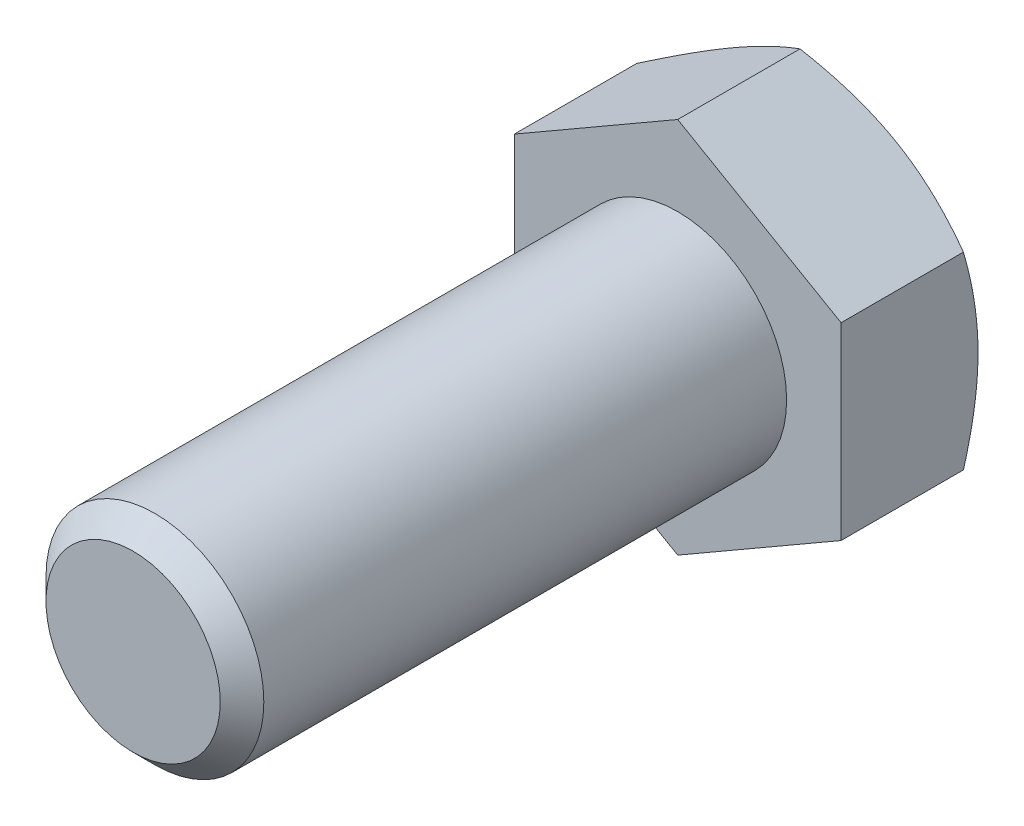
ISO-10303-21;
HEADER;
FILE_DESCRIPTION(('STEP AP214'),'2;1');
FILE_NAME('part.step','',(''),(''),'','','');
FILE_SCHEMA(('AUTOMOTIVE_DESIGN { 1 0 10303 214 1 1 1 1 }'));
ENDSEC;
DATA;
#1=APPLICATION_CONTEXT('core data for automotive mechanical design processes');
#2=APPLICATION_PROTOCOL_DEFINITION('international standard','automotive_design',2000,#1);
#3=PRODUCT_CONTEXT('',#1,'mechanical');
#4=PRODUCT('Part','Part','',(#3));
#5=PRODUCT_RELATED_PRODUCT_CATEGORY('part','',(#4));
#6=PRODUCT_DEFINITION_FORMATION('','',#4);
#7=PRODUCT_DEFINITION_CONTEXT('part definition',#1,'design');
#8=PRODUCT_DEFINITION('design','',#6,#7);
#9=PRODUCT_DEFINITION_SHAPE('','',#8);
#10=(LENGTH_UNIT() NAMED_UNIT(*) SI_UNIT(.MILLI.,.METRE.));
#11=(NAMED_UNIT(*) PLANE_ANGLE_UNIT() SI_UNIT($,.RADIAN.));
#12=(NAMED_UNIT(*) SI_UNIT($,.STERADIAN.) SOLID_ANGLE_UNIT());
#13=UNCERTAINTY_MEASURE_WITH_UNIT(LENGTH_MEASURE(1.E-05),#10,'distance_accuracy_value','');
#14=(GEOMETRIC_REPRESENTATION_CONTEXT(3) GLOBAL_UNCERTAINTY_ASSIGNED_CONTEXT((#13)) GLOBAL_UNIT_ASSIGNED_CONTEXT((#10,
#11,#12)) REPRESENTATION_CONTEXT('',''));
#15=CARTESIAN_POINT('',(0.,0.,0.));
#16=DIRECTION('',(0.,0.,1.));
#17=DIRECTION('',(1.,0.,0.));
#18=AXIS2_PLACEMENT_3D('',#15,#16,#17);
#19=CARTESIAN_POINT('',(0.,0.,35.));
#20=DIRECTION('',(0.,0.,1.));
#21=DIRECTION('',(1.,0.,0.));
#22=AXIS2_PLACEMENT_3D('',#19,#20,#21);
#23=PLANE('',#22);
#24=CARTESIAN_POINT('',(0.,0.,35.));
#25=DIRECTION('',(0.,0.,1.));
#26=DIRECTION('',(1.,0.,0.));
#27=AXIS2_PLACEMENT_3D('',#24,#25,#26);
#28=CIRCLE('',#27,5.6);
#29=CARTESIAN_POINT('',(5.60000000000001,0.,35.));
#30=VERTEX_POINT('',#29);
#31=EDGE_CURVE('E205',#30,#30,#28,.T.);
#32=ORIENTED_EDGE('',*,*,#31,.T.);
#33=EDGE_LOOP('',(#32));
#34=FACE_BOUND('',#33,.T.);
#35=ADVANCED_FACE('F31',(#34),#23,.T.);
#36=CARTESIAN_POINT('',(0.,0.,0.));
#37=DIRECTION('',(0.,0.,1.));
#38=DIRECTION('',(1.,0.,0.));
#39=AXIS2_PLACEMENT_3D('',#36,#37,#38);
#40=CYLINDRICAL_SURFACE('',#39,7.);
#41=CARTESIAN_POINT('',(0.,0.,33.6));
#42=DIRECTION('',(0.,0.,1.));
#43=DIRECTION('',(1.,0.,0.));
#44=AXIS2_PLACEMENT_3D('',#41,#42,#43);
#45=CIRCLE('',#44,7.);
#46=CARTESIAN_POINT('',(7.,0.,33.6));
#47=VERTEX_POINT('',#46);
#48=EDGE_CURVE('E207',#47,#47,#45,.F.);
#49=ORIENTED_EDGE('',*,*,#48,.T.);
#50=EDGE_LOOP('',(#49));
#51=FACE_BOUND('',#50,.T.);
#52=CARTESIAN_POINT('',(0.,0.,0.));
#53=DIRECTION('',(0.,0.,1.));
#54=DIRECTION('',(1.,0.,0.));
#55=AXIS2_PLACEMENT_3D('',#52,#53,#54);
#56=CIRCLE('',#55,7.);
#57=CARTESIAN_POINT('',(7.,0.,0.));
#58=VERTEX_POINT('',#57);
#59=EDGE_CURVE('E208',#58,#58,#56,.F.);
#60=ORIENTED_EDGE('',*,*,#59,.F.);
#61=EDGE_LOOP('',(#60));
#62=FACE_BOUND('',#61,.T.);
#63=ADVANCED_FACE('F196',(#51,#62),#40,.T.);
#64=CARTESIAN_POINT('',(0.,0.,35.));
#65=DIRECTION('',(0.,0.,-1.));
#66=DIRECTION('',(-1.,0.,0.));
#67=AXIS2_PLACEMENT_3D('',#64,#65,#66);
#68=CONICAL_SURFACE('',#67,5.6,0.785398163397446);
#69=ORIENTED_EDGE('',*,*,#48,.F.);
#70=EDGE_LOOP('',(#69));
#71=FACE_BOUND('',#70,.T.);
#72=ORIENTED_EDGE('',*,*,#31,.F.);
#73=EDGE_LOOP('',(#72));
#74=FACE_BOUND('',#73,.T.);
#75=ADVANCED_FACE('F201',(#71,#74),#68,.T.);
#76=CARTESIAN_POINT('',(0.,12.1243556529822,-8.8));
#77=DIRECTION('',(0.499999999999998,0.86602540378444,0.));
#78=DIRECTION('',(-0.86602540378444,0.499999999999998,0.));
#79=AXIS2_PLACEMENT_3D('',#76,#77,#78);
#80=PLANE('',#79);
#81=CARTESIAN_POINT('',(-0.000200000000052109,12.124471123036,-7.86211115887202));
#82=CARTESIAN_POINT('',(0.230612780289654,11.9912113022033,-7.93903608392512));
#83=CARTESIAN_POINT('',(0.462286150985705,11.8574546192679,-8.01246961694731));
#84=CARTESIAN_POINT('',(0.927490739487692,11.588868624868,-8.15138514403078));
#85=CARTESIAN_POINT('',(1.161022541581,11.4540389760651,-8.21686452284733));
#86=CARTESIAN_POINT('',(1.86538084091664,11.0473775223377,-8.40010423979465));
#87=CARTESIAN_POINT('',(2.33898788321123,10.7739403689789,-8.50433004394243));
#88=CARTESIAN_POINT('',(3.04771913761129,10.3647541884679,-8.62654435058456));
#89=CARTESIAN_POINT('',(3.28072597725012,10.2302276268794,-8.66135857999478));
#90=CARTESIAN_POINT('',(3.7478184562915,9.9605516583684,-8.71973973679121));
#91=CARTESIAN_POINT('',(3.98190411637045,9.82540223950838,-8.74330644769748));
#92=CARTESIAN_POINT('',(4.45046590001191,9.55487796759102,-8.77858873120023));
#93=CARTESIAN_POINT('',(4.68494122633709,9.41950357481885,-8.79031838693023));
#94=CARTESIAN_POINT('',(5.15410845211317,9.14862975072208,-8.80167731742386));
#95=CARTESIAN_POINT('',(5.38880034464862,9.01313032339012,-8.80130696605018));
#96=CARTESIAN_POINT('',(5.82756124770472,8.7598115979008,-8.78930773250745));
#97=CARTESIAN_POINT('',(6.03166122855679,8.64197441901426,-8.77914260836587));
#98=CARTESIAN_POINT('',(6.43938384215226,8.40657565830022,-8.74985839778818));
#99=CARTESIAN_POINT('',(6.64300644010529,8.28901409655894,-8.73073867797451));
#100=CARTESIAN_POINT('',(7.25308524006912,7.93678493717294,-8.6603996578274));
#101=CARTESIAN_POINT('',(7.65846156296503,7.70274080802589,-8.59620926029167));
#102=CARTESIAN_POINT('',(8.47351422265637,7.23216993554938,-8.43573291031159));
#103=CARTESIAN_POINT('',(8.88308654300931,6.99570324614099,-8.33876673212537));
#104=CARTESIAN_POINT('',(9.69612354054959,6.52629611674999,-8.11869386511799));
#105=CARTESIAN_POINT('',(10.0995986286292,6.29334966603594,-7.9956388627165));
#106=CARTESIAN_POINT('',(10.5002,6.06206235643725,-7.86211115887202));
#107=B_SPLINE_CURVE_WITH_KNOTS('',3,(#81,#82,#83,#84,#85,#86,#87,#88,#89,#90,#91,#92,#93,#94,
#95,#96,#97,#98,#99,#100,#101,#102,#103,#104,#105,#106),.UNSPECIFIED.,.F.,.F.,(4,2,2,2,2,2,2,2,
2,2,2,2,4),(0.,0.832130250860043,1.66453336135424,3.33288308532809,4.1465822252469,
4.96029702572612,5.77304256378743,6.58576298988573,7.29326708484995,8.00082123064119,
9.41693497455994,10.8644544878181,12.3091325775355),.UNSPECIFIED.);
#108=CARTESIAN_POINT('',(0.,12.1243556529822,-7.86217782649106));
#109=VERTEX_POINT('',#108);
#110=CARTESIAN_POINT('',(5.24999999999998,9.09326673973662,-8.8));
#111=VERTEX_POINT('',#110);
#112=EDGE_CURVE('E241',#109,#111,#107,.T.);
#113=ORIENTED_EDGE('',*,*,#112,.F.);
#114=DIRECTION('',(0.,0.,1.));
#115=VECTOR('',#114,1.);
#116=CARTESIAN_POINT('',(0.,12.1243556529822,-8.8));
#117=LINE('',#116,#115);
#118=CARTESIAN_POINT('',(0.,12.1243556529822,0.));
#119=VERTEX_POINT('',#118);
#120=EDGE_CURVE('E215',#109,#119,#117,.T.);
#121=ORIENTED_EDGE('',*,*,#120,.T.);
#122=DIRECTION('',(-0.86602540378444,0.499999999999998,0.));
#123=VECTOR('',#122,1.);
#124=CARTESIAN_POINT('',(0.,12.1243556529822,0.));
#125=LINE('',#124,#123);
#126=CARTESIAN_POINT('',(10.5,6.06217782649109,0.));
#127=VERTEX_POINT('',#126);
#128=EDGE_CURVE('E239',#127,#119,#125,.T.);
#129=ORIENTED_EDGE('',*,*,#128,.F.);
#130=DIRECTION('',(0.,0.,1.));
#131=VECTOR('',#130,1.);
#132=CARTESIAN_POINT('',(10.5,6.06217782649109,-8.8));
#133=LINE('',#132,#131);
#134=CARTESIAN_POINT('',(10.5,6.06217782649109,-7.86217782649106));
#135=VERTEX_POINT('',#134);
#136=EDGE_CURVE('E212',#135,#127,#133,.T.);
#137=ORIENTED_EDGE('',*,*,#136,.F.);
#138=EDGE_CURVE('E171',#111,#135,#107,.T.);
#139=ORIENTED_EDGE('',*,*,#138,.F.);
#140=EDGE_LOOP('',(#113,#121,#129,#137,#139));
#141=FACE_BOUND('',#140,.T.);
#142=ADVANCED_FACE('F181',(#141),#80,.T.);
#143=CARTESIAN_POINT('',(10.5,-6.06217782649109,-8.8));
#144=DIRECTION('',(1.,0.,0.));
#145=DIRECTION('',(0.,0.,-1.));
#146=AXIS2_PLACEMENT_3D('',#143,#144,#145);
#147=PLANE('',#146);
#148=CARTESIAN_POINT('',(10.5,-16.5629789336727,-3.53989491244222));
#149=CARTESIAN_POINT('',(10.5,-16.3324493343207,-3.65230404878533));
#150=CARTESIAN_POINT('',(10.5,-16.1016566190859,-3.76417333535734));
#151=CARTESIAN_POINT('',(10.5,-15.6394901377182,-3.98671045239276));
#152=CARTESIAN_POINT('',(10.5,-15.4081163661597,-4.09737827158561));
#153=CARTESIAN_POINT('',(10.5,-14.712983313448,-4.42742432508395));
#154=CARTESIAN_POINT('',(10.5,-14.248276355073,-4.64481383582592));
#155=CARTESIAN_POINT('',(10.5,-13.3134466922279,-5.07413775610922));
#156=CARTESIAN_POINT('',(10.5,-12.8433084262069,-5.2860383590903));
#157=CARTESIAN_POINT('',(10.5,-11.8993888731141,-5.70153466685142));
#158=CARTESIAN_POINT('',(10.5,-11.4256077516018,-5.90513074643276));
#159=CARTESIAN_POINT('',(10.5,-10.4574367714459,-6.30858523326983));
#160=CARTESIAN_POINT('',(10.5,-9.96289464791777,-6.50808008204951));
#161=CARTESIAN_POINT('',(10.5,-8.96812552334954,-6.89263703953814));
#162=CARTESIAN_POINT('',(10.5,-8.46789790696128,-7.07769756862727));
#163=CARTESIAN_POINT('',(10.5,-7.46182642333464,-7.42872878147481));
#164=CARTESIAN_POINT('',(10.5,-6.95599532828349,-7.59473578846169));
#165=CARTESIAN_POINT('',(10.5,-5.93703641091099,-7.90252989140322));
#166=CARTESIAN_POINT('',(10.5,-5.42391085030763,-8.0443243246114));
#167=CARTESIAN_POINT('',(10.5,-4.65004411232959,-8.23348309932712));
#168=CARTESIAN_POINT('',(10.5,-4.39213073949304,-8.29247932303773));
#169=CARTESIAN_POINT('',(10.5,-3.87449212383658,-8.40194855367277));
#170=CARTESIAN_POINT('',(10.5,-3.61476691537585,-8.45242172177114));
#171=CARTESIAN_POINT('',(10.5,-3.0936645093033,-8.54397190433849));
#172=CARTESIAN_POINT('',(10.5,-2.83228735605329,-8.58504917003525));
#173=CARTESIAN_POINT('',(10.5,-2.30813350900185,-8.65699998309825));
#174=CARTESIAN_POINT('',(10.5,-2.04535687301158,-8.68787394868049));
#175=CARTESIAN_POINT('',(10.5,-1.52232395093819,-8.7384014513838));
#176=CARTESIAN_POINT('',(10.5,-1.26208192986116,-8.75820173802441));
#177=CARTESIAN_POINT('',(10.5,-0.740993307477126,-8.78676818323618));
#178=CARTESIAN_POINT('',(10.5,-0.480146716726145,-8.79553453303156));
#179=CARTESIAN_POINT('',(10.5,0.0416860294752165,-8.80182303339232));
#180=CARTESIAN_POINT('',(10.5,0.302672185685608,-8.79934512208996));
#181=CARTESIAN_POINT('',(10.5,0.824301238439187,-8.78320850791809));
#182=CARTESIAN_POINT('',(10.5,1.08494411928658,-8.76954931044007));
#183=CARTESIAN_POINT('',(10.5,1.70298182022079,-8.72419928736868));
#184=CARTESIAN_POINT('',(10.5,2.0600298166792,-8.68766932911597));
#185=CARTESIAN_POINT('',(10.5,2.77164016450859,-8.59555782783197));
#186=CARTESIAN_POINT('',(10.5,3.12620220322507,-8.53997393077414));
#187=CARTESIAN_POINT('',(10.5,4.18565161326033,-8.34757543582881));
#188=CARTESIAN_POINT('',(10.5,4.88595752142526,-8.1851428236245));
#189=CARTESIAN_POINT('',(10.5,5.93370494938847,-7.90132203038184));
#190=CARTESIAN_POINT('',(10.5,6.28651822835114,-7.79860514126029));
#191=CARTESIAN_POINT('',(10.5,6.98872323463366,-7.58197095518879));
#192=CARTESIAN_POINT('',(10.5,7.33811493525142,-7.4680535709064));
#193=CARTESIAN_POINT('',(10.5,8.03358066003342,-7.23088999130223));
#194=CARTESIAN_POINT('',(10.5,8.37965557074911,-7.10764637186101));
#195=CARTESIAN_POINT('',(10.5,9.06889903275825,-6.85333339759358));
#196=CARTESIAN_POINT('',(10.5,9.41206765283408,-6.72226422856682));
#197=CARTESIAN_POINT('',(10.5,10.3427918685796,-6.35655861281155));
#198=CARTESIAN_POINT('',(10.5,10.9278216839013,-6.11549981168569));
#199=CARTESIAN_POINT('',(10.5,12.0917802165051,-5.61902471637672));
#200=CARTESIAN_POINT('',(10.5,12.6707082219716,-5.36360676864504));
#201=CARTESIAN_POINT('',(10.5,13.8238790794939,-4.8418421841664));
#202=CARTESIAN_POINT('',(10.5,14.398119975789,-4.5754912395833));
#203=CARTESIAN_POINT('',(10.5,15.542640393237,-4.03450017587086));
#204=CARTESIAN_POINT('',(10.5,16.1129200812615,-3.75986040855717));
#205=CARTESIAN_POINT('',(10.5,17.2512491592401,-3.20365321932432));
#206=CARTESIAN_POINT('',(10.5,17.8192933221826,-2.9220751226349));
#207=CARTESIAN_POINT('',(10.5,18.952807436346,-2.35378095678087));
#208=CARTESIAN_POINT('',(10.5,19.5182773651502,-2.06706484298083));
#209=CARTESIAN_POINT('',(10.5,20.6469787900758,-1.48957659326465));
#210=CARTESIAN_POINT('',(10.5,21.210210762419,-1.19880538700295));
#211=CARTESIAN_POINT('',(10.5,22.3349267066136,-0.613909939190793));
#212=CARTESIAN_POINT('',(10.5,22.8964106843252,-0.319785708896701));
#213=CARTESIAN_POINT('',(10.5,24.4583663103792,0.50329927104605));
#214=CARTESIAN_POINT('',(10.5,25.4572548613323,1.03526359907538));
#215=CARTESIAN_POINT('',(10.5,27.4516969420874,2.10554559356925));
#216=CARTESIAN_POINT('',(10.5,28.4472502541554,2.64386366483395));
#217=CARTESIAN_POINT('',(10.5,30.4323747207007,3.7233782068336));
#218=CARTESIAN_POINT('',(10.5,31.4219546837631,4.26455848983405));
#219=CARTESIAN_POINT('',(10.5,32.9047991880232,5.07900862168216));
#220=CARTESIAN_POINT('',(10.5,33.3988066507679,5.35092764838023));
#221=CARTESIAN_POINT('',(10.5,34.3863794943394,5.89556593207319));
#222=CARTESIAN_POINT('',(10.5,34.8799448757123,6.16828518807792));
#223=CARTESIAN_POINT('',(10.5,35.3733163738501,6.44135483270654));
#224=B_SPLINE_CURVE_WITH_KNOTS('',3,(#148,#149,#150,#151,#152,#153,#154,#155,#156,#157,#158,
#159,#160,#161,#162,#163,#164,#165,#166,#167,#168,#169,#170,#171,#172,#173,#174,#175,#176,#177,
#178,#179,#180,#181,#182,#183,#184,#185,#186,#187,#188,#189,#190,#191,#192,#193,#194,#195,#196,
#197,#198,#199,#200,#201,#202,#203,#204,#205,#206,#207,#208,#209,#210,#211,#212,#213,#214,#215,
#216,#217,#218,#219,#220,#221,#222,#223),.UNSPECIFIED.,.F.,.F.,(4,2,2,2,2,2,2,2,2,2,2,2,2,2,2,2,
2,2,2,2,2,2,2,2,2,2,2,2,2,2,2,2,2,2,2,2,2,4),(0.,0.769425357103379,1.53885792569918,
3.07793697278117,4.62493168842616,6.17185650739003,7.77147528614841,9.37126887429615,
10.9679601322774,12.5641666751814,13.357773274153,14.1513648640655,14.9449352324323,
15.7384730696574,16.5212293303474,17.303972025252,18.0867190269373,18.8695006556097,
19.9456341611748,21.0219006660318,23.1754668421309,24.2777514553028,25.3800446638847,
26.4820345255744,27.5839982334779,29.4819519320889,31.380124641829,33.279052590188,
35.1779000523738,37.0798780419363,38.9818725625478,40.8834379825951,42.7849970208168,
46.1800870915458,49.5753946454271,52.9590658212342,54.650765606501,56.3424632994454),.UNSPECIFIED.);
#225=CARTESIAN_POINT('',(10.5,0.,-8.8));
#226=VERTEX_POINT('',#225);
#227=EDGE_CURVE('E169',#135,#226,#224,.F.);
#228=ORIENTED_EDGE('',*,*,#227,.F.);
#229=ORIENTED_EDGE('',*,*,#136,.T.);
#230=DIRECTION('',(0.,1.,0.));
#231=VECTOR('',#230,1.);
#232=CARTESIAN_POINT('',(10.5,-6.06217782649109,0.));
#233=LINE('',#232,#231);
#234=CARTESIAN_POINT('',(10.5,-6.06217782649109,0.));
#235=VERTEX_POINT('',#234);
#236=EDGE_CURVE('E217',#235,#127,#233,.T.);
#237=ORIENTED_EDGE('',*,*,#236,.F.);
#238=DIRECTION('',(0.,0.,1.));
#239=VECTOR('',#238,1.);
#240=CARTESIAN_POINT('',(10.5,-6.06217782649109,-8.8));
#241=LINE('',#240,#239);
#242=CARTESIAN_POINT('',(10.5,-6.06217782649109,-7.86217782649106));
#243=VERTEX_POINT('',#242);
#244=EDGE_CURVE('E223',#243,#235,#241,.T.);
#245=ORIENTED_EDGE('',*,*,#244,.F.);
#246=EDGE_CURVE('E164',#226,#243,#224,.F.);
#247=ORIENTED_EDGE('',*,*,#246,.F.);
#248=EDGE_LOOP('',(#228,#229,#237,#245,#247));
#249=FACE_BOUND('',#248,.T.);
#250=ADVANCED_FACE('F177',(#249),#147,.T.);
#251=CARTESIAN_POINT('',(0.,-12.1243556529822,-8.8));
#252=DIRECTION('',(0.499999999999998,-0.86602540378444,0.));
#253=DIRECTION('',(0.86602540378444,0.499999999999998,0.));
#254=AXIS2_PLACEMENT_3D('',#251,#252,#253);
#255=PLANE('',#254);
#256=CARTESIAN_POINT('',(10.5002,-6.06206235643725,-7.86211115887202));
#257=CARTESIAN_POINT('',(10.2693872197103,-6.19532217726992,-7.93903608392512));
#258=CARTESIAN_POINT('',(10.0377138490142,-6.32907886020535,-8.01246961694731));
#259=CARTESIAN_POINT('',(9.57250926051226,-6.59766485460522,-8.15138514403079));
#260=CARTESIAN_POINT('',(9.33897745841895,-6.73249450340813,-8.21686452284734));
#261=CARTESIAN_POINT('',(8.63461915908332,-7.1391559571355,-8.40010423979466));
#262=CARTESIAN_POINT('',(8.16101211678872,-7.41259311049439,-8.50433004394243));
#263=CARTESIAN_POINT('',(7.45228086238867,-7.82177929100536,-8.62654435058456));
#264=CARTESIAN_POINT('',(7.21927402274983,-7.95630585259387,-8.66135857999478));
#265=CARTESIAN_POINT('',(6.75218154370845,-8.22598182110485,-8.71973973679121));
#266=CARTESIAN_POINT('',(6.5180958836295,-8.36113123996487,-8.74330644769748));
#267=CARTESIAN_POINT('',(6.04953409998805,-8.63165551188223,-8.77858873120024));
#268=CARTESIAN_POINT('',(5.81505877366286,-8.7670299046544,-8.79031838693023));
#269=CARTESIAN_POINT('',(5.34589154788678,-9.03790372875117,-8.80167731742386));
#270=CARTESIAN_POINT('',(5.11119965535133,-9.17340315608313,-8.80130696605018));
#271=CARTESIAN_POINT('',(4.67243875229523,-9.42672188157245,-8.78930773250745));
#272=CARTESIAN_POINT('',(4.46833877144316,-9.54455906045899,-8.77914260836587));
#273=CARTESIAN_POINT('',(4.06061615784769,-9.77995782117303,-8.74985839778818));
#274=CARTESIAN_POINT('',(3.85699355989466,-9.89751938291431,-8.73073867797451));
#275=CARTESIAN_POINT('',(3.24691475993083,-10.2497485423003,-8.6603996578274));
#276=CARTESIAN_POINT('',(2.84153843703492,-10.4837926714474,-8.59620926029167));
#277=CARTESIAN_POINT('',(2.02648577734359,-10.9543635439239,-8.43573291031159));
#278=CARTESIAN_POINT('',(1.61691345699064,-11.1908302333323,-8.33876673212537));
#279=CARTESIAN_POINT('',(0.803876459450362,-11.6602373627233,-8.11869386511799));
#280=CARTESIAN_POINT('',(0.40040137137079,-11.8931838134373,-7.99563886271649));
#281=CARTESIAN_POINT('',(-0.000200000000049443,-12.124471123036,-7.86211115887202));
#282=B_SPLINE_CURVE_WITH_KNOTS('',3,(#256,#257,#258,#259,#260,#261,#262,#263,#264,#265,#266,
#267,#268,#269,#270,#271,#272,#273,#274,#275,#276,#277,#278,#279,#280,#281),.UNSPECIFIED.,.F.,
.F.,(4,2,2,2,2,2,2,2,2,2,2,2,4),(0.,0.832130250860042,1.66453336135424,3.33288308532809,
4.1465822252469,4.96029702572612,5.77304256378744,6.58576298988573,7.29326708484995,
8.00082123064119,9.41693497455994,10.8644544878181,12.3091325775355),.UNSPECIFIED.);
#283=CARTESIAN_POINT('',(5.24999999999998,-9.09326673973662,-8.8));
#284=VERTEX_POINT('',#283);
#285=EDGE_CURVE('E170',#243,#284,#282,.T.);
#286=ORIENTED_EDGE('',*,*,#285,.F.);
#287=ORIENTED_EDGE('',*,*,#244,.T.);
#288=DIRECTION('',(0.86602540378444,0.499999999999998,0.));
#289=VECTOR('',#288,1.);
#290=CARTESIAN_POINT('',(0.,-12.1243556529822,0.));
#291=LINE('',#290,#289);
#292=CARTESIAN_POINT('',(0.,-12.1243556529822,0.));
#293=VERTEX_POINT('',#292);
#294=EDGE_CURVE('E228',#293,#235,#291,.T.);
#295=ORIENTED_EDGE('',*,*,#294,.F.);
#296=DIRECTION('',(0.,0.,1.));
#297=VECTOR('',#296,1.);
#298=CARTESIAN_POINT('',(0.,-12.1243556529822,-8.8));
#299=LINE('',#298,#297);
#300=CARTESIAN_POINT('',(0.,-12.1243556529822,-7.86217782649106));
#301=VERTEX_POINT('',#300);
#302=EDGE_CURVE('E221',#301,#293,#299,.T.);
#303=ORIENTED_EDGE('',*,*,#302,.F.);
#304=EDGE_CURVE('E158',#284,#301,#282,.T.);
#305=ORIENTED_EDGE('',*,*,#304,.F.);
#306=EDGE_LOOP('',(#286,#287,#295,#303,#305));
#307=FACE_BOUND('',#306,.T.);
#308=ADVANCED_FACE('F180',(#307),#255,.T.);
#309=CARTESIAN_POINT('',(0.,-12.1243556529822,-8.8));
#310=DIRECTION('',(-0.500000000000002,-0.866025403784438,0.));
#311=DIRECTION('',(0.866025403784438,-0.500000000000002,0.));
#312=AXIS2_PLACEMENT_3D('',#309,#310,#311);
#313=PLANE('',#312);
#314=CARTESIAN_POINT('',(0.000199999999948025,-12.124471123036,-7.86211115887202));
#315=CARTESIAN_POINT('',(-0.230612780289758,-11.9912113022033,-7.93903608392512));
#316=CARTESIAN_POINT('',(-0.462286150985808,-11.8574546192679,-8.0124696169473));
#317=CARTESIAN_POINT('',(-0.927490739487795,-11.588868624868,-8.15138514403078));
#318=CARTESIAN_POINT('',(-1.1610225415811,-11.4540389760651,-8.21686452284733));
#319=CARTESIAN_POINT('',(-1.86538084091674,-11.0473775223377,-8.40010423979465));
#320=CARTESIAN_POINT('',(-2.33898788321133,-10.7739403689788,-8.50433004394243));
#321=CARTESIAN_POINT('',(-3.04771913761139,-10.3647541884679,-8.62654435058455));
#322=CARTESIAN_POINT('',(-3.28072597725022,-10.2302276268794,-8.66135857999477));
#323=CARTESIAN_POINT('',(-3.74781845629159,-9.96055165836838,-8.7197397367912));
#324=CARTESIAN_POINT('',(-3.98190411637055,-9.82540223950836,-8.74330644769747));
#325=CARTESIAN_POINT('',(-4.450465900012,-9.554877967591,-8.77858873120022));
#326=CARTESIAN_POINT('',(-4.68494122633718,-9.41950357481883,-8.79031838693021));
#327=CARTESIAN_POINT('',(-5.15410845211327,-9.14862975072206,-8.80167731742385));
#328=CARTESIAN_POINT('',(-5.38880034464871,-9.01313032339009,-8.80130696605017));
#329=CARTESIAN_POINT('',(-5.82756124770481,-8.75981159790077,-8.78930773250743));
#330=CARTESIAN_POINT('',(-6.03166122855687,-8.64197441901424,-8.77914260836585));
#331=CARTESIAN_POINT('',(-6.43938384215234,-8.40657565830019,-8.74985839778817));
#332=CARTESIAN_POINT('',(-6.64300644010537,-8.28901409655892,-8.73073867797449));
#333=CARTESIAN_POINT('',(-7.25308524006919,-7.93678493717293,-8.66039965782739));
#334=CARTESIAN_POINT('',(-7.65846156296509,-7.70274080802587,-8.59620926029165));
#335=CARTESIAN_POINT('',(-8.47351422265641,-7.23216993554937,-8.43573291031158));
#336=CARTESIAN_POINT('',(-8.88308654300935,-6.99570324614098,-8.33876673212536));
#337=CARTESIAN_POINT('',(-9.69612354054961,-6.52629611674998,-8.11869386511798));
#338=CARTESIAN_POINT('',(-10.0995986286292,-6.29334966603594,-7.99563886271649));
#339=CARTESIAN_POINT('',(-10.5002,-6.06206235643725,-7.86211115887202));
#340=B_SPLINE_CURVE_WITH_KNOTS('',3,(#314,#315,#316,#317,#318,#319,#320,#321,#322,#323,#324,
#325,#326,#327,#328,#329,#330,#331,#332,#333,#334,#335,#336,#337,#338,#339),.UNSPECIFIED.,.F.,
.F.,(4,2,2,2,2,2,2,2,2,2,2,2,4),(0.,0.832130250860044,1.66453336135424,3.33288308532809,
4.1465822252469,4.96029702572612,5.77304256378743,6.58576298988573,7.29326708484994,
8.00082123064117,9.4169349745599,10.864454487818,12.3091325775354),.UNSPECIFIED.);
#341=CARTESIAN_POINT('',(-5.25000000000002,-9.0932667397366,-8.8));
#342=VERTEX_POINT('',#341);
#343=EDGE_CURVE('E260',#301,#342,#340,.T.);
#344=ORIENTED_EDGE('',*,*,#343,.F.);
#345=ORIENTED_EDGE('',*,*,#302,.T.);
#346=DIRECTION('',(0.866025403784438,-0.500000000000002,0.));
#347=VECTOR('',#346,1.);
#348=CARTESIAN_POINT('',(0.,-12.1243556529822,0.));
#349=LINE('',#348,#347);
#350=CARTESIAN_POINT('',(-10.5,-6.06217782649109,0.));
#351=VERTEX_POINT('',#350);
#352=EDGE_CURVE('E231',#351,#293,#349,.T.);
#353=ORIENTED_EDGE('',*,*,#352,.F.);
#354=DIRECTION('',(0.,0.,1.));
#355=VECTOR('',#354,1.);
#356=CARTESIAN_POINT('',(-10.5,-6.06217782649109,-8.8));
#357=LINE('',#356,#355);
#358=CARTESIAN_POINT('',(-10.5,-6.06217782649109,-7.86217782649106));
#359=VERTEX_POINT('',#358);
#360=EDGE_CURVE('E219',#359,#351,#357,.T.);
#361=ORIENTED_EDGE('',*,*,#360,.F.);
#362=EDGE_CURVE('E107',#342,#359,#340,.T.);
#363=ORIENTED_EDGE('',*,*,#362,.F.);
#364=EDGE_LOOP('',(#344,#345,#353,#361,#363));
#365=FACE_BOUND('',#364,.T.);
#366=ADVANCED_FACE('F185',(#365),#313,.T.);
#367=CARTESIAN_POINT('',(-10.5,-6.06217782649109,-8.8));
#368=DIRECTION('',(-1.,0.,0.));
#369=DIRECTION('',(0.,0.,1.));
#370=AXIS2_PLACEMENT_3D('',#367,#368,#369);
#371=PLANE('',#370);
#372=CARTESIAN_POINT('',(-10.5,-16.5629789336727,-3.53989491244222));
#373=CARTESIAN_POINT('',(-10.5,-16.3324493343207,-3.65230404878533));
#374=CARTESIAN_POINT('',(-10.5,-16.1016566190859,-3.76417333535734));
#375=CARTESIAN_POINT('',(-10.5,-15.6394901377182,-3.98671045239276));
#376=CARTESIAN_POINT('',(-10.5,-15.4081163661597,-4.09737827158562));
#377=CARTESIAN_POINT('',(-10.5,-14.712983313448,-4.42742432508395));
#378=CARTESIAN_POINT('',(-10.5,-14.248276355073,-4.64481383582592));
#379=CARTESIAN_POINT('',(-10.5,-13.3134466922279,-5.07413775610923));
#380=CARTESIAN_POINT('',(-10.5,-12.8433084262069,-5.2860383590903));
#381=CARTESIAN_POINT('',(-10.5,-11.8993888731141,-5.70153466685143));
#382=CARTESIAN_POINT('',(-10.5,-11.4256077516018,-5.90513074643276));
#383=CARTESIAN_POINT('',(-10.5,-10.4574367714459,-6.30858523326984));
#384=CARTESIAN_POINT('',(-10.5,-9.96289464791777,-6.50808008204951));
#385=CARTESIAN_POINT('',(-10.5,-8.96812552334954,-6.89263703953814));
#386=CARTESIAN_POINT('',(-10.5,-8.46789790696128,-7.07769756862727));
#387=CARTESIAN_POINT('',(-10.5,-7.46182642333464,-7.42872878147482));
#388=CARTESIAN_POINT('',(-10.5,-6.95599532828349,-7.59473578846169));
#389=CARTESIAN_POINT('',(-10.5,-5.93703641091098,-7.90252989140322));
#390=CARTESIAN_POINT('',(-10.5,-5.42391085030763,-8.0443243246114));
#391=CARTESIAN_POINT('',(-10.5,-4.65004411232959,-8.23348309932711));
#392=CARTESIAN_POINT('',(-10.5,-4.39213073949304,-8.29247932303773));
#393=CARTESIAN_POINT('',(-10.5,-3.87449212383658,-8.40194855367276));
#394=CARTESIAN_POINT('',(-10.5,-3.61476691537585,-8.45242172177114));
#395=CARTESIAN_POINT('',(-10.5,-3.09366450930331,-8.54397190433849));
#396=CARTESIAN_POINT('',(-10.5,-2.83228735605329,-8.58504917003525));
#397=CARTESIAN_POINT('',(-10.5,-2.30813350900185,-8.65699998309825));
#398=CARTESIAN_POINT('',(-10.5,-2.04535687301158,-8.68787394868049));
#399=CARTESIAN_POINT('',(-10.5,-1.5223239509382,-8.73840145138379));
#400=CARTESIAN_POINT('',(-10.5,-1.26208192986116,-8.75820173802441));
#401=CARTESIAN_POINT('',(-10.5,-0.740993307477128,-8.78676818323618));
#402=CARTESIAN_POINT('',(-10.5,-0.480146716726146,-8.79553453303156));
#403=CARTESIAN_POINT('',(-10.5,0.0416860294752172,-8.80182303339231));
#404=CARTESIAN_POINT('',(-10.5,0.302672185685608,-8.79934512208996));
#405=CARTESIAN_POINT('',(-10.5,0.824301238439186,-8.78320850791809));
#406=CARTESIAN_POINT('',(-10.5,1.08494411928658,-8.76954931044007));
#407=CARTESIAN_POINT('',(-10.5,1.70298182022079,-8.72419928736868));
#408=CARTESIAN_POINT('',(-10.5,2.0600298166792,-8.68766932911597));
#409=CARTESIAN_POINT('',(-10.5,2.77164016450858,-8.59555782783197));
#410=CARTESIAN_POINT('',(-10.5,3.12620220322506,-8.53997393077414));
#411=CARTESIAN_POINT('',(-10.5,4.18565161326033,-8.34757543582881));
#412=CARTESIAN_POINT('',(-10.5,4.88595752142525,-8.18514282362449));
#413=CARTESIAN_POINT('',(-10.5,5.93370494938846,-7.90132203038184));
#414=CARTESIAN_POINT('',(-10.5,6.28651822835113,-7.79860514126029));
#415=CARTESIAN_POINT('',(-10.5,6.98872323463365,-7.5819709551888));
#416=CARTESIAN_POINT('',(-10.5,7.33811493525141,-7.4680535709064));
#417=CARTESIAN_POINT('',(-10.5,8.03358066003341,-7.23088999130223));
#418=CARTESIAN_POINT('',(-10.5,8.3796555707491,-7.10764637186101));
#419=CARTESIAN_POINT('',(-10.5,9.06889903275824,-6.85333339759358));
#420=CARTESIAN_POINT('',(-10.5,9.41206765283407,-6.72226422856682));
#421=CARTESIAN_POINT('',(-10.5,10.3427918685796,-6.35655861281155));
#422=CARTESIAN_POINT('',(-10.5,10.9278216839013,-6.11549981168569));
#423=CARTESIAN_POINT('',(-10.5,12.0917802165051,-5.61902471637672));
#424=CARTESIAN_POINT('',(-10.5,12.6707082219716,-5.36360676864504));
#425=CARTESIAN_POINT('',(-10.5,13.8238790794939,-4.8418421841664));
#426=CARTESIAN_POINT('',(-10.5,14.398119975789,-4.5754912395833));
#427=CARTESIAN_POINT('',(-10.5,15.542640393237,-4.03450017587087));
#428=CARTESIAN_POINT('',(-10.5,16.1129200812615,-3.75986040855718));
#429=CARTESIAN_POINT('',(-10.5,17.2512491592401,-3.20365321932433));
#430=CARTESIAN_POINT('',(-10.5,17.8192933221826,-2.9220751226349));
#431=CARTESIAN_POINT('',(-10.5,18.9528074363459,-2.35378095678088));
#432=CARTESIAN_POINT('',(-10.5,19.5182773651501,-2.06706484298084));
#433=CARTESIAN_POINT('',(-10.5,20.6469787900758,-1.48957659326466));
#434=CARTESIAN_POINT('',(-10.5,21.210210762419,-1.19880538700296));
#435=CARTESIAN_POINT('',(-10.5,22.3349267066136,-0.613909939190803));
#436=CARTESIAN_POINT('',(-10.5,22.8964106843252,-0.319785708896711));
#437=CARTESIAN_POINT('',(-10.5,24.4583663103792,0.503299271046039));
#438=CARTESIAN_POINT('',(-10.5,25.4572548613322,1.03526359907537));
#439=CARTESIAN_POINT('',(-10.5,27.4516969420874,2.10554559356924));
#440=CARTESIAN_POINT('',(-10.5,28.4472502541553,2.64386366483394));
#441=CARTESIAN_POINT('',(-10.5,30.4323747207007,3.7233782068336));
#442=CARTESIAN_POINT('',(-10.5,31.4219546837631,4.26455848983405));
#443=CARTESIAN_POINT('',(-10.5,32.9047991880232,5.07900862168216));
#444=CARTESIAN_POINT('',(-10.5,33.3988066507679,5.35092764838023));
#445=CARTESIAN_POINT('',(-10.5,34.3863794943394,5.89556593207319));
#446=CARTESIAN_POINT('',(-10.5,34.8799448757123,6.16828518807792));
#447=CARTESIAN_POINT('',(-10.5,35.3733163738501,6.44135483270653));
#448=B_SPLINE_CURVE_WITH_KNOTS('',3,(#372,#373,#374,#375,#376,#377,#378,#379,#380,#381,#382,
#383,#384,#385,#386,#387,#388,#389,#390,#391,#392,#393,#394,#395,#396,#397,#398,#399,#400,#401,
#402,#403,#404,#405,#406,#407,#408,#409,#410,#411,#412,#413,#414,#415,#416,#417,#418,#419,#420,
#421,#422,#423,#424,#425,#426,#427,#428,#429,#430,#431,#432,#433,#434,#435,#436,#437,#438,#439,
#440,#441,#442,#443,#444,#445,#446,#447),.UNSPECIFIED.,.F.,.F.,(4,2,2,2,2,2,2,2,2,2,2,2,2,2,2,2,
2,2,2,2,2,2,2,2,2,2,2,2,2,2,2,2,2,2,2,2,2,4),(0.,0.769425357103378,1.53885792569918,
3.07793697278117,4.62493168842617,6.17185650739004,7.77147528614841,9.37126887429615,
10.9679601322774,12.5641666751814,13.357773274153,14.1513648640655,14.9449352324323,
15.7384730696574,16.5212293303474,17.303972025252,18.0867190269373,18.8695006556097,
19.9456341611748,21.0219006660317,23.1754668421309,24.2777514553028,25.3800446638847,
26.4820345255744,27.5839982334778,29.4819519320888,31.380124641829,33.279052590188,
35.1779000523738,37.0798780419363,38.9818725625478,40.8834379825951,42.7849970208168,
46.1800870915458,49.575394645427,52.9590658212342,54.650765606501,56.3424632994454),.UNSPECIFIED.);
#449=CARTESIAN_POINT('',(-10.5,0.,-8.8));
#450=VERTEX_POINT('',#449);
#451=EDGE_CURVE('E102',#359,#450,#448,.T.);
#452=ORIENTED_EDGE('',*,*,#451,.F.);
#453=ORIENTED_EDGE('',*,*,#360,.T.);
#454=DIRECTION('',(0.,-1.,0.));
#455=VECTOR('',#454,1.);
#456=CARTESIAN_POINT('',(-10.5,-6.06217782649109,0.));
#457=LINE('',#456,#455);
#458=CARTESIAN_POINT('',(-10.5,6.06217782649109,0.));
#459=VERTEX_POINT('',#458);
#460=EDGE_CURVE('E234',#459,#351,#457,.T.);
#461=ORIENTED_EDGE('',*,*,#460,.F.);
#462=DIRECTION('',(0.,0.,1.));
#463=VECTOR('',#462,1.);
#464=CARTESIAN_POINT('',(-10.5,6.06217782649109,-8.8));
#465=LINE('',#464,#463);
#466=CARTESIAN_POINT('',(-10.5,6.06217782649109,-7.86217782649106));
#467=VERTEX_POINT('',#466);
#468=EDGE_CURVE('E128',#467,#459,#465,.T.);
#469=ORIENTED_EDGE('',*,*,#468,.F.);
#470=EDGE_CURVE('E111',#450,#467,#448,.T.);
#471=ORIENTED_EDGE('',*,*,#470,.F.);
#472=EDGE_LOOP('',(#452,#453,#461,#469,#471));
#473=FACE_BOUND('',#472,.T.);
#474=ADVANCED_FACE('F126',(#473),#371,.T.);
#475=CARTESIAN_POINT('',(-10.5,6.06217782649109,-8.8));
#476=DIRECTION('',(-0.500000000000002,0.866025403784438,0.));
#477=DIRECTION('',(-0.866025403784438,-0.500000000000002,0.));
#478=AXIS2_PLACEMENT_3D('',#475,#476,#477);
#479=PLANE('',#478);
#480=CARTESIAN_POINT('',(-10.5002,6.06206235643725,-7.86211115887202));
#481=CARTESIAN_POINT('',(-10.2693872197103,6.19532217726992,-7.93903608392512));
#482=CARTESIAN_POINT('',(-10.0377138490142,6.32907886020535,-8.01246961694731));
#483=CARTESIAN_POINT('',(-9.57250926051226,6.59766485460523,-8.15138514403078));
#484=CARTESIAN_POINT('',(-9.33897745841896,6.73249450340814,-8.21686452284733));
#485=CARTESIAN_POINT('',(-8.63461915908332,7.13915595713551,-8.40010423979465));
#486=CARTESIAN_POINT('',(-8.16101211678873,7.4125931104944,-8.50433004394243));
#487=CARTESIAN_POINT('',(-7.45228086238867,7.82177929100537,-8.62654435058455));
#488=CARTESIAN_POINT('',(-7.21927402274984,7.95630585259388,-8.66135857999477));
#489=CARTESIAN_POINT('',(-6.75218154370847,8.22598182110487,-8.7197397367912));
#490=CARTESIAN_POINT('',(-6.51809588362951,8.36113123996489,-8.74330644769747));
#491=CARTESIAN_POINT('',(-6.04953409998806,8.63165551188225,-8.77858873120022));
#492=CARTESIAN_POINT('',(-5.81505877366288,8.76702990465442,-8.79031838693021));
#493=CARTESIAN_POINT('',(-5.34589154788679,9.03790372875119,-8.80167731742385));
#494=CARTESIAN_POINT('',(-5.11119965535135,9.17340315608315,-8.80130696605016));
#495=CARTESIAN_POINT('',(-4.67243875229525,9.42672188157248,-8.78930773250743));
#496=CARTESIAN_POINT('',(-4.46833877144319,9.54455906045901,-8.77914260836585));
#497=CARTESIAN_POINT('',(-4.06061615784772,9.77995782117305,-8.74985839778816));
#498=CARTESIAN_POINT('',(-3.85699355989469,9.89751938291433,-8.73073867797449));
#499=CARTESIAN_POINT('',(-3.24691475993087,10.2497485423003,-8.66039965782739));
#500=CARTESIAN_POINT('',(-2.84153843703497,10.4837926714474,-8.59620926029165));
#501=CARTESIAN_POINT('',(-2.02648577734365,10.9543635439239,-8.43573291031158));
#502=CARTESIAN_POINT('',(-1.61691345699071,11.1908302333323,-8.33876673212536));
#503=CARTESIAN_POINT('',(-0.803876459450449,11.6602373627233,-8.11869386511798));
#504=CARTESIAN_POINT('',(-0.400401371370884,11.8931838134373,-7.99563886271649));
#505=CARTESIAN_POINT('',(0.000199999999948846,12.124471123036,-7.86211115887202));
#506=B_SPLINE_CURVE_WITH_KNOTS('',3,(#480,#481,#482,#483,#484,#485,#486,#487,#488,#489,#490,
#491,#492,#493,#494,#495,#496,#497,#498,#499,#500,#501,#502,#503,#504,#505),.UNSPECIFIED.,.F.,
.F.,(4,2,2,2,2,2,2,2,2,2,2,2,4),(0.,0.832130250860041,1.66453336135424,3.33288308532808,
4.14658222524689,4.96029702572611,5.77304256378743,6.58576298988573,7.29326708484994,
8.00082123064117,9.4169349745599,10.864454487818,12.3091325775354),.UNSPECIFIED.);
#507=CARTESIAN_POINT('',(-5.25000000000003,9.09326673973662,-8.8));
#508=VERTEX_POINT('',#507);
#509=EDGE_CURVE('E117',#467,#508,#506,.T.);
#510=ORIENTED_EDGE('',*,*,#509,.F.);
#511=ORIENTED_EDGE('',*,*,#468,.T.);
#512=DIRECTION('',(-0.866025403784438,-0.500000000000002,0.));
#513=VECTOR('',#512,1.);
#514=CARTESIAN_POINT('',(-10.5,6.06217782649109,0.));
#515=LINE('',#514,#513);
#516=EDGE_CURVE('E237',#119,#459,#515,.T.);
#517=ORIENTED_EDGE('',*,*,#516,.F.);
#518=ORIENTED_EDGE('',*,*,#120,.F.);
#519=EDGE_CURVE('E119',#508,#109,#506,.T.);
#520=ORIENTED_EDGE('',*,*,#519,.F.);
#521=EDGE_LOOP('',(#510,#511,#517,#518,#520));
#522=FACE_BOUND('',#521,.T.);
#523=ADVANCED_FACE('F193',(#522),#479,.T.);
#524=CARTESIAN_POINT('',(10.5,6.06217782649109,0.));
#525=DIRECTION('',(0.,0.,1.));
#526=DIRECTION('',(1.,0.,0.));
#527=AXIS2_PLACEMENT_3D('',#524,#525,#526);
#528=PLANE('',#527);
#529=ORIENTED_EDGE('',*,*,#59,.T.);
#530=EDGE_LOOP('',(#529));
#531=FACE_BOUND('',#530,.T.);
#532=ORIENTED_EDGE('',*,*,#128,.T.);
#533=ORIENTED_EDGE('',*,*,#516,.T.);
#534=ORIENTED_EDGE('',*,*,#460,.T.);
#535=ORIENTED_EDGE('',*,*,#352,.T.);
#536=ORIENTED_EDGE('',*,*,#294,.T.);
#537=ORIENTED_EDGE('',*,*,#236,.T.);
#538=EDGE_LOOP('',(#532,#533,#534,#535,#536,#537));
#539=FACE_BOUND('',#538,.T.);
#540=ADVANCED_FACE('F150',(#531,#539),#528,.T.);
#541=CARTESIAN_POINT('',(0.,0.,0.));
#542=DIRECTION('',(0.,0.,1.));
#543=DIRECTION('',(1.,0.,0.));
#544=AXIS2_PLACEMENT_3D('',#541,#542,#543);
#545=CONICAL_SURFACE('',#544,25.7420471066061,1.0471975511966);
#546=ORIENTED_EDGE('',*,*,#138,.T.);
#547=ORIENTED_EDGE('',*,*,#227,.T.);
#548=CARTESIAN_POINT('',(0.,0.,-8.8));
#549=DIRECTION('',(0.,0.,1.));
#550=DIRECTION('',(1.,0.,0.));
#551=AXIS2_PLACEMENT_3D('',#548,#549,#550);
#552=CIRCLE('',#551,10.5);
#553=EDGE_CURVE('E34',#111,#226,#552,.F.);
#554=ORIENTED_EDGE('',*,*,#553,.F.);
#555=EDGE_LOOP('',(#546,#547,#554));
#556=FACE_BOUND('',#555,.T.);
#557=ADVANCED_FACE('F250',(#556),#545,.T.);
#558=ORIENTED_EDGE('',*,*,#112,.T.);
#559=EDGE_CURVE('E124',#508,#111,#552,.F.);
#560=ORIENTED_EDGE('',*,*,#559,.F.);
#561=ORIENTED_EDGE('',*,*,#519,.T.);
#562=EDGE_LOOP('',(#558,#560,#561));
#563=FACE_BOUND('',#562,.T.);
#564=ADVANCED_FACE('F149',(#563),#545,.T.);
#565=ORIENTED_EDGE('',*,*,#470,.T.);
#566=ORIENTED_EDGE('',*,*,#509,.T.);
#567=CARTESIAN_POINT('',(0.,0.,-8.8));
#568=DIRECTION('',(0.,0.,-1.));
#569=DIRECTION('',(-1.,0.,0.));
#570=AXIS2_PLACEMENT_3D('',#567,#568,#569);
#571=CIRCLE('',#570,10.5);
#572=EDGE_CURVE('E52',#450,#508,#571,.T.);
#573=ORIENTED_EDGE('',*,*,#572,.F.);
#574=EDGE_LOOP('',(#565,#566,#573));
#575=FACE_BOUND('',#574,.T.);
#576=ADVANCED_FACE('F115',(#575),#545,.T.);
#577=ORIENTED_EDGE('',*,*,#362,.T.);
#578=ORIENTED_EDGE('',*,*,#451,.T.);
#579=EDGE_CURVE('E104',#342,#450,#552,.F.);
#580=ORIENTED_EDGE('',*,*,#579,.F.);
#581=EDGE_LOOP('',(#577,#578,#580));
#582=FACE_BOUND('',#581,.T.);
#583=ADVANCED_FACE('F103',(#582),#545,.T.);
#584=ORIENTED_EDGE('',*,*,#304,.T.);
#585=ORIENTED_EDGE('',*,*,#343,.T.);
#586=EDGE_CURVE('E39',#284,#342,#552,.F.);
#587=ORIENTED_EDGE('',*,*,#586,.F.);
#588=EDGE_LOOP('',(#584,#585,#587));
#589=FACE_BOUND('',#588,.T.);
#590=ADVANCED_FACE('F262',(#589),#545,.T.);
#591=ORIENTED_EDGE('',*,*,#246,.T.);
#592=ORIENTED_EDGE('',*,*,#285,.T.);
#593=EDGE_CURVE('E11',#226,#284,#552,.F.);
#594=ORIENTED_EDGE('',*,*,#593,.F.);
#595=EDGE_LOOP('',(#591,#592,#594));
#596=FACE_BOUND('',#595,.T.);
#597=ADVANCED_FACE('F257',(#596),#545,.T.);
#598=CARTESIAN_POINT('',(10.5,6.06217782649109,-8.8));
#599=DIRECTION('',(0.,0.,1.));
#600=DIRECTION('',(1.,0.,0.));
#601=AXIS2_PLACEMENT_3D('',#598,#599,#600);
#602=PLANE('',#601);
#603=ORIENTED_EDGE('',*,*,#553,.T.);
#604=ORIENTED_EDGE('',*,*,#593,.T.);
#605=ORIENTED_EDGE('',*,*,#586,.T.);
#606=ORIENTED_EDGE('',*,*,#579,.T.);
#607=ORIENTED_EDGE('',*,*,#572,.T.);
#608=ORIENTED_EDGE('',*,*,#559,.T.);
#609=EDGE_LOOP('',(#603,#604,#605,#606,#607,#608));
#610=FACE_BOUND('',#609,.T.);
#611=ADVANCED_FACE('F122',(#610),#602,.F.);
#612=CLOSED_SHELL('',(#35,#63,#75,#142,#250,#308,#366,#474,#523,#540,#557,#564,#576,#583,#590,
#597,#611));
#613=MANIFOLD_SOLID_BREP('B2',#612);
#614=ADVANCED_BREP_SHAPE_REPRESENTATION('',(#18,#613),#14);
#615=SHAPE_DEFINITION_REPRESENTATION(#9,#614);
ENDSEC;
END-ISO-10303-21;
